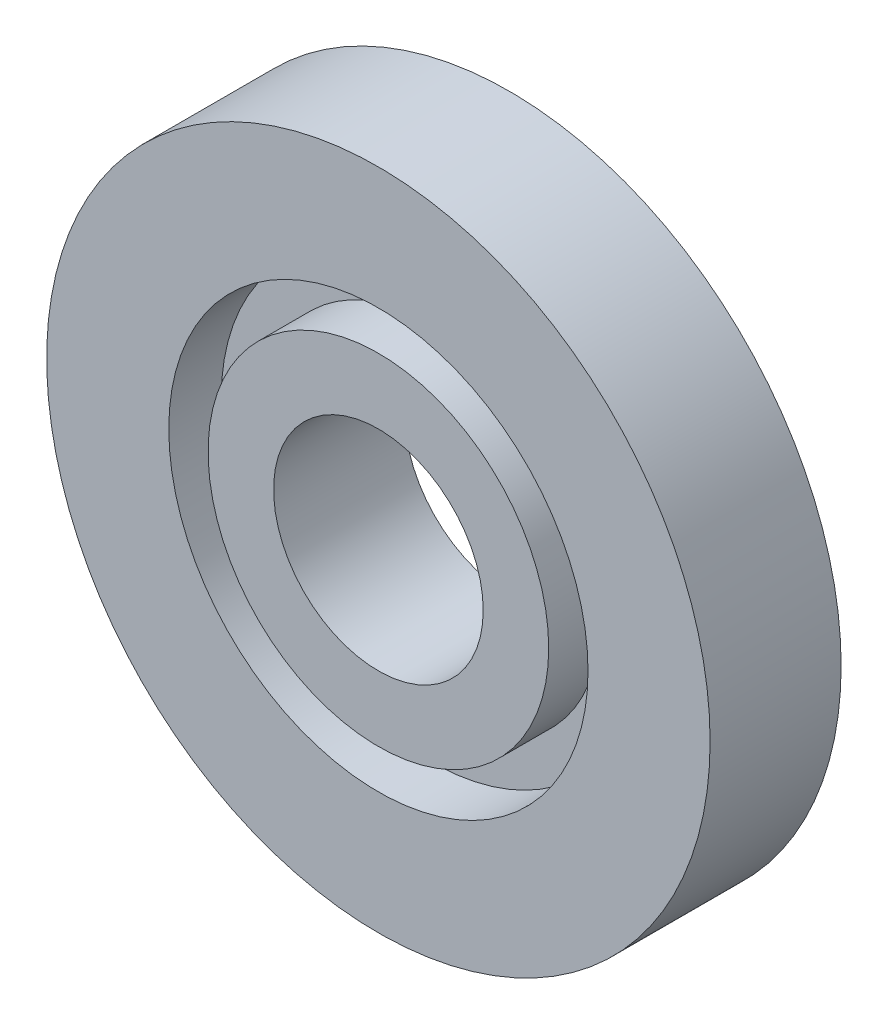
from build123d import *

# Parameters (mm, degrees)
CROQUIS1_R              = 6.33
SALIENTE_EXTRUIR2_DEPTH = 2.5
CROQUIS2_R              = 2
CORTAR_EXTRUIR1_DEPTH   = 5
CROQUIS3_R              = 4
CROQUIS3_R_2            = 3.25
CORTAR_EXTRUIR2_DEPTH   = 1
CORTAR_EXTRUIR3_START   = -1
CROQUIS4_R              = 4
CROQUIS4_R_2            = 3.25
CORTAR_EXTRUIR3_DEPTH   = 1


with BuildPart() as part:
    # Croquis1 → Saliente-Extruir2 (new body)
    with BuildSketch(Plane.XY):
        Circle(CROQUIS1_R)
    extrude(amount=SALIENTE_EXTRUIR2_DEPTH)

    # Croquis2 → Cortar-Extruir1 (cut)
    with BuildSketch(Plane.XY.offset(2.5)):
        Circle(CROQUIS2_R)
    extrude(amount=-CORTAR_EXTRUIR1_DEPTH, mode=Mode.SUBTRACT)

    # Croquis3 → Cortar-Extruir2 (cut)
    with BuildSketch(Plane.XY.offset(2.5)):
        Circle(CROQUIS3_R)
        Circle(CROQUIS3_R_2, mode=Mode.SUBTRACT)
    extrude(amount=-CORTAR_EXTRUIR2_DEPTH, mode=Mode.SUBTRACT)

    # Croquis4 → Cortar-Extruir3 (cut)
    with BuildSketch(Plane(origin=(0, 0, 0), x_dir=(-1, 0, 0), z_dir=(0, 0, -1)).offset(CORTAR_EXTRUIR3_START)):
        with Locations(Location((0, 0, 0), (0, 0, 180))):
            Circle(CROQUIS4_R)
        with Locations(Location((0, 0, 0), (0, 0, 180))):
            Circle(CROQUIS4_R_2, mode=Mode.SUBTRACT)
    extrude(amount=CORTAR_EXTRUIR3_DEPTH, mode=Mode.SUBTRACT)


solid = part.part
